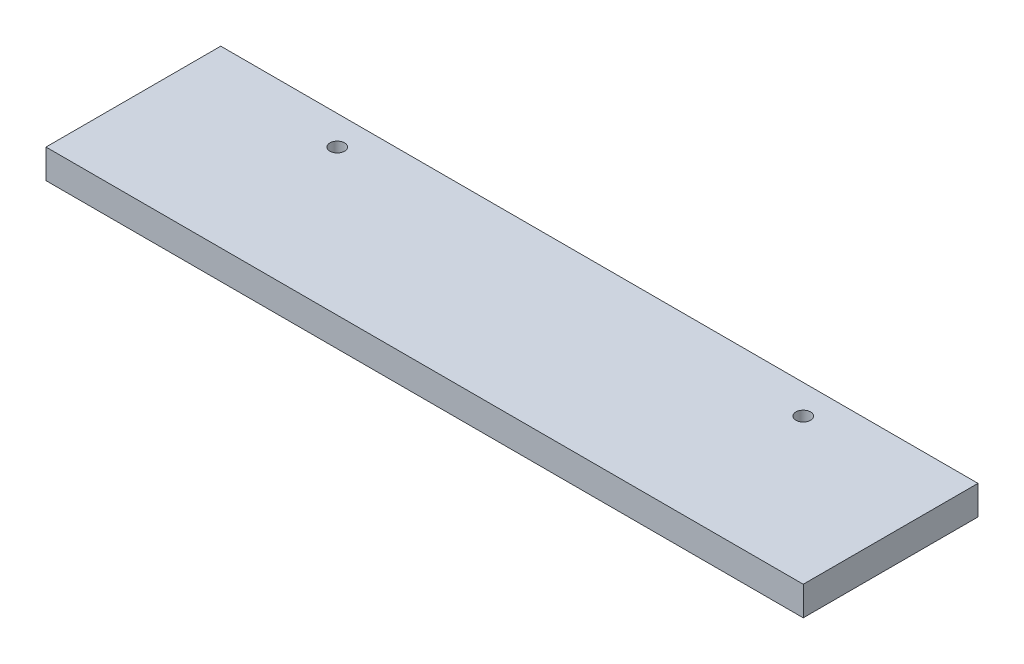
ISO-10303-21;
HEADER;
FILE_DESCRIPTION(('STEP AP214'),'2;1');
FILE_NAME('part.step','',(''),(''),'','','');
FILE_SCHEMA(('AUTOMOTIVE_DESIGN { 1 0 10303 214 1 1 1 1 }'));
ENDSEC;
DATA;
#1=APPLICATION_CONTEXT('core data for automotive mechanical design processes');
#2=APPLICATION_PROTOCOL_DEFINITION('international standard','automotive_design',2000,#1);
#3=PRODUCT_CONTEXT('',#1,'mechanical');
#4=PRODUCT('Part','Part','',(#3));
#5=PRODUCT_RELATED_PRODUCT_CATEGORY('part','',(#4));
#6=PRODUCT_DEFINITION_FORMATION('','',#4);
#7=PRODUCT_DEFINITION_CONTEXT('part definition',#1,'design');
#8=PRODUCT_DEFINITION('design','',#6,#7);
#9=PRODUCT_DEFINITION_SHAPE('','',#8);
#10=(LENGTH_UNIT() NAMED_UNIT(*) SI_UNIT(.MILLI.,.METRE.));
#11=(NAMED_UNIT(*) PLANE_ANGLE_UNIT() SI_UNIT($,.RADIAN.));
#12=(NAMED_UNIT(*) SI_UNIT($,.STERADIAN.) SOLID_ANGLE_UNIT());
#13=UNCERTAINTY_MEASURE_WITH_UNIT(LENGTH_MEASURE(1.E-05),#10,'distance_accuracy_value','');
#14=(GEOMETRIC_REPRESENTATION_CONTEXT(3) GLOBAL_UNCERTAINTY_ASSIGNED_CONTEXT((#13)) GLOBAL_UNIT_ASSIGNED_CONTEXT((#10,
#11,#12)) REPRESENTATION_CONTEXT('',''));
#15=CARTESIAN_POINT('',(0.,0.,0.));
#16=DIRECTION('',(0.,0.,1.));
#17=DIRECTION('',(1.,0.,0.));
#18=AXIS2_PLACEMENT_3D('',#15,#16,#17);
#19=CARTESIAN_POINT('',(0.,3.175,0.));
#20=DIRECTION('',(1.,0.,0.));
#21=DIRECTION('',(0.,0.,-1.));
#22=AXIS2_PLACEMENT_3D('',#19,#20,#21);
#23=PLANE('',#22);
#24=DIRECTION('',(0.,0.,1.));
#25=VECTOR('',#24,1.);
#26=CARTESIAN_POINT('',(0.,0.,0.));
#27=LINE('',#26,#25);
#28=CARTESIAN_POINT('',(0.,0.,-19.05));
#29=VERTEX_POINT('',#28);
#30=CARTESIAN_POINT('',(0.,0.,0.));
#31=VERTEX_POINT('',#30);
#32=EDGE_CURVE('E108',#29,#31,#27,.T.);
#33=ORIENTED_EDGE('',*,*,#32,.T.);
#34=DIRECTION('',(0.,-1.,0.));
#35=VECTOR('',#34,1.);
#36=CARTESIAN_POINT('',(0.,3.175,0.));
#37=LINE('',#36,#35);
#38=CARTESIAN_POINT('',(0.,3.175,0.));
#39=VERTEX_POINT('',#38);
#40=EDGE_CURVE('E11',#39,#31,#37,.T.);
#41=ORIENTED_EDGE('',*,*,#40,.F.);
#42=DIRECTION('',(0.,0.,1.));
#43=VECTOR('',#42,1.);
#44=CARTESIAN_POINT('',(0.,3.175,0.));
#45=LINE('',#44,#43);
#46=CARTESIAN_POINT('',(0.,3.175,-19.05));
#47=VERTEX_POINT('',#46);
#48=EDGE_CURVE('E92',#47,#39,#45,.T.);
#49=ORIENTED_EDGE('',*,*,#48,.F.);
#50=DIRECTION('',(0.,-1.,0.));
#51=VECTOR('',#50,1.);
#52=CARTESIAN_POINT('',(0.,3.175,-19.05));
#53=LINE('',#52,#51);
#54=EDGE_CURVE('E104',#47,#29,#53,.T.);
#55=ORIENTED_EDGE('',*,*,#54,.T.);
#56=EDGE_LOOP('',(#33,#41,#49,#55));
#57=FACE_BOUND('',#56,.T.);
#58=ADVANCED_FACE('F40',(#57),#23,.F.);
#59=CARTESIAN_POINT('',(0.,3.175,0.));
#60=DIRECTION('',(0.,0.,-1.));
#61=DIRECTION('',(-1.,0.,0.));
#62=AXIS2_PLACEMENT_3D('',#59,#60,#61);
#63=PLANE('',#62);
#64=DIRECTION('',(1.,0.,0.));
#65=VECTOR('',#64,1.);
#66=CARTESIAN_POINT('',(0.,0.,0.));
#67=LINE('',#66,#65);
#68=CARTESIAN_POINT('',(82.55,0.,0.));
#69=VERTEX_POINT('',#68);
#70=EDGE_CURVE('E97',#31,#69,#67,.T.);
#71=ORIENTED_EDGE('',*,*,#70,.T.);
#72=DIRECTION('',(0.,-1.,0.));
#73=VECTOR('',#72,1.);
#74=CARTESIAN_POINT('',(82.55,3.175,0.));
#75=LINE('',#74,#73);
#76=CARTESIAN_POINT('',(82.55,3.175,0.));
#77=VERTEX_POINT('',#76);
#78=EDGE_CURVE('E49',#77,#69,#75,.T.);
#79=ORIENTED_EDGE('',*,*,#78,.F.);
#80=DIRECTION('',(1.,0.,0.));
#81=VECTOR('',#80,1.);
#82=CARTESIAN_POINT('',(0.,3.175,0.));
#83=LINE('',#82,#81);
#84=EDGE_CURVE('E87',#39,#77,#83,.T.);
#85=ORIENTED_EDGE('',*,*,#84,.F.);
#86=ORIENTED_EDGE('',*,*,#40,.T.);
#87=EDGE_LOOP('',(#71,#79,#85,#86));
#88=FACE_BOUND('',#87,.T.);
#89=ADVANCED_FACE('F96',(#88),#63,.F.);
#90=CARTESIAN_POINT('',(82.55,3.175,0.));
#91=DIRECTION('',(-1.,0.,0.));
#92=DIRECTION('',(0.,0.,1.));
#93=AXIS2_PLACEMENT_3D('',#90,#91,#92);
#94=PLANE('',#93);
#95=DIRECTION('',(0.,0.,-1.));
#96=VECTOR('',#95,1.);
#97=CARTESIAN_POINT('',(82.55,0.,0.));
#98=LINE('',#97,#96);
#99=CARTESIAN_POINT('',(82.55,0.,-19.05));
#100=VERTEX_POINT('',#99);
#101=EDGE_CURVE('E74',#69,#100,#98,.T.);
#102=ORIENTED_EDGE('',*,*,#101,.T.);
#103=DIRECTION('',(0.,-1.,0.));
#104=VECTOR('',#103,1.);
#105=CARTESIAN_POINT('',(82.55,3.175,-19.05));
#106=LINE('',#105,#104);
#107=CARTESIAN_POINT('',(82.55,3.175,-19.05));
#108=VERTEX_POINT('',#107);
#109=EDGE_CURVE('E99',#108,#100,#106,.T.);
#110=ORIENTED_EDGE('',*,*,#109,.F.);
#111=DIRECTION('',(0.,0.,-1.));
#112=VECTOR('',#111,1.);
#113=CARTESIAN_POINT('',(82.55,3.175,0.));
#114=LINE('',#113,#112);
#115=EDGE_CURVE('E90',#77,#108,#114,.T.);
#116=ORIENTED_EDGE('',*,*,#115,.F.);
#117=ORIENTED_EDGE('',*,*,#78,.T.);
#118=EDGE_LOOP('',(#102,#110,#116,#117));
#119=FACE_BOUND('',#118,.T.);
#120=ADVANCED_FACE('F100',(#119),#94,.F.);
#121=CARTESIAN_POINT('',(0.,3.175,-19.05));
#122=DIRECTION('',(0.,0.,1.));
#123=DIRECTION('',(1.,0.,0.));
#124=AXIS2_PLACEMENT_3D('',#121,#122,#123);
#125=PLANE('',#124);
#126=DIRECTION('',(-1.,0.,0.));
#127=VECTOR('',#126,1.);
#128=CARTESIAN_POINT('',(0.,0.,-19.05));
#129=LINE('',#128,#127);
#130=EDGE_CURVE('E80',#100,#29,#129,.T.);
#131=ORIENTED_EDGE('',*,*,#130,.T.);
#132=ORIENTED_EDGE('',*,*,#54,.F.);
#133=DIRECTION('',(-1.,0.,0.));
#134=VECTOR('',#133,1.);
#135=CARTESIAN_POINT('',(0.,3.175,-19.05));
#136=LINE('',#135,#134);
#137=EDGE_CURVE('E57',#108,#47,#136,.T.);
#138=ORIENTED_EDGE('',*,*,#137,.F.);
#139=ORIENTED_EDGE('',*,*,#109,.T.);
#140=EDGE_LOOP('',(#131,#132,#138,#139));
#141=FACE_BOUND('',#140,.T.);
#142=ADVANCED_FACE('F122',(#141),#125,.F.);
#143=CARTESIAN_POINT('',(0.,3.175,0.));
#144=DIRECTION('',(0.,-1.,0.));
#145=DIRECTION('',(0.,0.,-1.));
#146=AXIS2_PLACEMENT_3D('',#143,#144,#145);
#147=PLANE('',#146);
#148=CARTESIAN_POINT('',(15.875,3.175,-15.875));
#149=DIRECTION('',(0.,1.,0.));
#150=DIRECTION('',(0.,0.,1.));
#151=AXIS2_PLACEMENT_3D('',#148,#149,#150);
#152=CIRCLE('',#151,0.793749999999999);
#153=CARTESIAN_POINT('',(15.875,3.175,-15.08125));
#154=VERTEX_POINT('',#153);
#155=EDGE_CURVE('E137',#154,#154,#152,.T.);
#156=ORIENTED_EDGE('',*,*,#155,.F.);
#157=EDGE_LOOP('',(#156));
#158=FACE_BOUND('',#157,.T.);
#159=CARTESIAN_POINT('',(66.675,3.175,-15.875));
#160=DIRECTION('',(0.,1.,0.));
#161=DIRECTION('',(0.,0.,1.));
#162=AXIS2_PLACEMENT_3D('',#159,#160,#161);
#163=CIRCLE('',#162,0.793749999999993);
#164=CARTESIAN_POINT('',(66.675,3.175,-15.08125));
#165=VERTEX_POINT('',#164);
#166=EDGE_CURVE('E129',#165,#165,#163,.T.);
#167=ORIENTED_EDGE('',*,*,#166,.F.);
#168=EDGE_LOOP('',(#167));
#169=FACE_BOUND('',#168,.T.);
#170=ORIENTED_EDGE('',*,*,#48,.T.);
#171=ORIENTED_EDGE('',*,*,#84,.T.);
#172=ORIENTED_EDGE('',*,*,#115,.T.);
#173=ORIENTED_EDGE('',*,*,#137,.T.);
#174=EDGE_LOOP('',(#170,#171,#172,#173));
#175=FACE_BOUND('',#174,.T.);
#176=ADVANCED_FACE('F88',(#158,#169,#175),#147,.F.);
#177=CARTESIAN_POINT('',(0.,0.,0.));
#178=DIRECTION('',(0.,-1.,0.));
#179=DIRECTION('',(0.,0.,-1.));
#180=AXIS2_PLACEMENT_3D('',#177,#178,#179);
#181=PLANE('',#180);
#182=CARTESIAN_POINT('',(15.875,0.,-15.875));
#183=DIRECTION('',(0.,1.,0.));
#184=DIRECTION('',(0.,0.,1.));
#185=AXIS2_PLACEMENT_3D('',#182,#183,#184);
#186=CIRCLE('',#185,0.793749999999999);
#187=CARTESIAN_POINT('',(15.875,0.,-15.08125));
#188=VERTEX_POINT('',#187);
#189=EDGE_CURVE('E112',#188,#188,#186,.T.);
#190=ORIENTED_EDGE('',*,*,#189,.T.);
#191=EDGE_LOOP('',(#190));
#192=FACE_BOUND('',#191,.T.);
#193=CARTESIAN_POINT('',(66.675,0.,-15.875));
#194=DIRECTION('',(0.,1.,0.));
#195=DIRECTION('',(0.,0.,1.));
#196=AXIS2_PLACEMENT_3D('',#193,#194,#195);
#197=CIRCLE('',#196,0.793749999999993);
#198=CARTESIAN_POINT('',(66.675,0.,-15.08125));
#199=VERTEX_POINT('',#198);
#200=EDGE_CURVE('E133',#199,#199,#197,.T.);
#201=ORIENTED_EDGE('',*,*,#200,.T.);
#202=EDGE_LOOP('',(#201));
#203=FACE_BOUND('',#202,.T.);
#204=ORIENTED_EDGE('',*,*,#32,.F.);
#205=ORIENTED_EDGE('',*,*,#130,.F.);
#206=ORIENTED_EDGE('',*,*,#101,.F.);
#207=ORIENTED_EDGE('',*,*,#70,.F.);
#208=EDGE_LOOP('',(#204,#205,#206,#207));
#209=FACE_BOUND('',#208,.T.);
#210=ADVANCED_FACE('F125',(#192,#203,#209),#181,.T.);
#211=CARTESIAN_POINT('',(66.675,0.,-15.875));
#212=DIRECTION('',(0.,1.,0.));
#213=DIRECTION('',(0.,0.,1.));
#214=AXIS2_PLACEMENT_3D('',#211,#212,#213);
#215=CYLINDRICAL_SURFACE('',#214,0.793749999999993);
#216=ORIENTED_EDGE('',*,*,#200,.F.);
#217=EDGE_LOOP('',(#216));
#218=FACE_BOUND('',#217,.T.);
#219=ORIENTED_EDGE('',*,*,#166,.T.);
#220=EDGE_LOOP('',(#219));
#221=FACE_BOUND('',#220,.T.);
#222=ADVANCED_FACE('F150',(#218,#221),#215,.F.);
#223=CARTESIAN_POINT('',(15.875,0.,-15.875));
#224=DIRECTION('',(0.,1.,0.));
#225=DIRECTION('',(0.,0.,1.));
#226=AXIS2_PLACEMENT_3D('',#223,#224,#225);
#227=CYLINDRICAL_SURFACE('',#226,0.793749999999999);
#228=ORIENTED_EDGE('',*,*,#189,.F.);
#229=EDGE_LOOP('',(#228));
#230=FACE_BOUND('',#229,.T.);
#231=ORIENTED_EDGE('',*,*,#155,.T.);
#232=EDGE_LOOP('',(#231));
#233=FACE_BOUND('',#232,.T.);
#234=ADVANCED_FACE('F147',(#230,#233),#227,.F.);
#235=CLOSED_SHELL('',(#58,#89,#120,#142,#176,#210,#222,#234));
#236=MANIFOLD_SOLID_BREP('B2',#235);
#237=ADVANCED_BREP_SHAPE_REPRESENTATION('',(#18,#236),#14);
#238=SHAPE_DEFINITION_REPRESENTATION(#9,#237);
ENDSEC;
END-ISO-10303-21;
